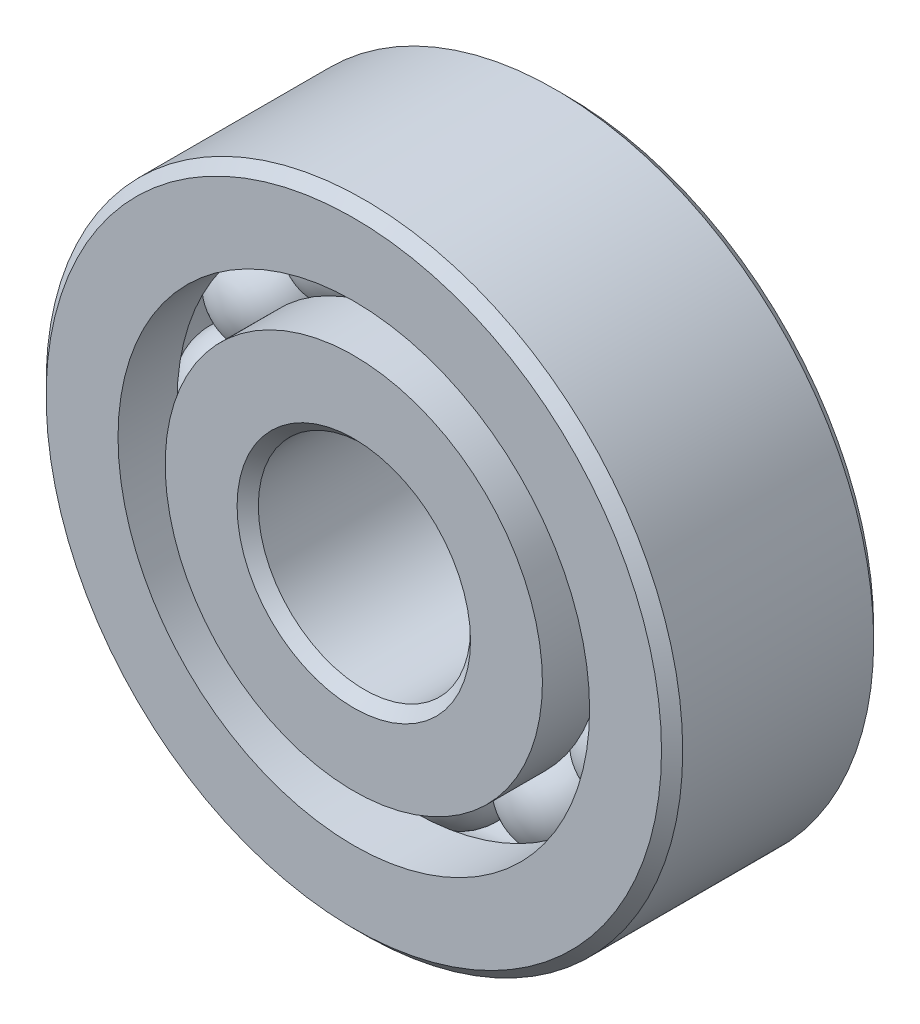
from build123d import *

# Parameters (mm, degrees)
CIRPATTERN1_COUNT = 12


with BuildPart() as part:
    # Sketch2 → Revolve1 (revolve)
    with BuildSketch(Plane(origin=(0, 0, 0), x_dir=(0, 0, -1), z_dir=(1, 0, 0)), mode=Mode.PRIVATE) as revolve1_sk:
        with BuildLine():
            Line((-0.5, 0.888888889), (-0.222222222, 0.888888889))
            ThreePointArc((-0.222222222, 0.888888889), (0, 0.751548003), (0.222222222, 0.888888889))
            Line((0.222222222, 0.888888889), (0.5, 0.888888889))
            Line((0.5, 0.888888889), (0.5, 0.55))
            Line((0.5, 0.55), (0.45, 0.5))
            Line((0.45, 0.5), (-0.45, 0.5))
            Line((-0.45, 0.5), (-0.5, 0.55))
            Line((-0.5, 0.55), (-0.5, 0.888888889))
        make_face()
        with BuildLine():
            Line((0.45, 1.5), (0.5, 1.45))
            Line((0.5, 1.45), (0.5, 1.111111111))
            Line((0.5, 1.111111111), (0.222222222, 1.111111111))
            ThreePointArc((0.222222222, 1.111111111), (0, 1.248451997), (-0.222222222, 1.111111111))
            Line((-0.222222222, 1.111111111), (-0.5, 1.111111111))
            Line((-0.5, 1.111111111), (-0.5, 1.45))
            Line((-0.5, 1.45), (-0.45, 1.5))
            Line((-0.45, 1.5), (0.45, 1.5))
        make_face()
    revolve(revolve1_sk.sketch.rotate(Axis((0, 0, 0.5), (0, 0, -1)), 90), axis=Axis((0, 0, 0.5), (0, 0, -1)))


with BuildPart() as body_2:
    # Sketch3 → Revolve2 (revolve)
    with BuildSketch(Plane(origin=(0, 0, 0), x_dir=(0, 0, -1), z_dir=(1, 0, 0))):
        with BuildLine():
            Line((-0.248451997, 1), (0.248451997, 1))
            ThreePointArc((0.248451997, 1), (0, 1.248451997), (-0.248451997, 1))
        make_face()
    revolve(axis=Axis((0, 1, 0.248451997), (0, 0, -1)))


with BuildPart() as cirpattern1_1:
    # CirPattern1: pattern copy
    add(body_2.part.rotate(Axis((0, 0, 0), (0, 0, 1)), 1 * 360 / CIRPATTERN1_COUNT))


with BuildPart() as cirpattern1_2:
    # CirPattern1: pattern copy
    add(body_2.part.rotate(Axis((0, 0, 0), (0, 0, 1)), 2 * 360 / CIRPATTERN1_COUNT))


with BuildPart() as cirpattern1_3:
    # CirPattern1: pattern copy
    add(body_2.part.rotate(Axis((0, 0, 0), (0, 0, 1)), 3 * 360 / CIRPATTERN1_COUNT))


with BuildPart() as cirpattern1_4:
    # CirPattern1: pattern copy
    add(body_2.part.rotate(Axis((0, 0, 0), (0, 0, 1)), 4 * 360 / CIRPATTERN1_COUNT))


with BuildPart() as cirpattern1_5:
    # CirPattern1: pattern copy
    add(body_2.part.rotate(Axis((0, 0, 0), (0, 0, 1)), 5 * 360 / CIRPATTERN1_COUNT))


with BuildPart() as cirpattern1_6:
    # CirPattern1: pattern copy
    add(body_2.part.rotate(Axis((0, 0, 0), (0, 0, 1)), 6 * 360 / CIRPATTERN1_COUNT))


with BuildPart() as cirpattern1_7:
    # CirPattern1: pattern copy
    add(body_2.part.rotate(Axis((0, 0, 0), (0, 0, 1)), 7 * 360 / CIRPATTERN1_COUNT))


with BuildPart() as cirpattern1_8:
    # CirPattern1: pattern copy
    add(body_2.part.rotate(Axis((0, 0, 0), (0, 0, 1)), 8 * 360 / CIRPATTERN1_COUNT))


with BuildPart() as cirpattern1_9:
    # CirPattern1: pattern copy
    add(body_2.part.rotate(Axis((0, 0, 0), (0, 0, 1)), 9 * 360 / CIRPATTERN1_COUNT))


with BuildPart() as cirpattern1_10:
    # CirPattern1: pattern copy
    add(body_2.part.rotate(Axis((0, 0, 0), (0, 0, 1)), 10 * 360 / CIRPATTERN1_COUNT))


with BuildPart() as cirpattern1_11:
    # CirPattern1: pattern copy
    add(body_2.part.rotate(Axis((0, 0, 0), (0, 0, 1)), 11 * 360 / CIRPATTERN1_COUNT))


solid = Compound([part.part, body_2.part, cirpattern1_1.part, cirpattern1_2.part, cirpattern1_3.part, cirpattern1_4.part, cirpattern1_5.part, cirpattern1_6.part, cirpattern1_7.part, cirpattern1_8.part, cirpattern1_9.part, cirpattern1_10.part, cirpattern1_11.part])
